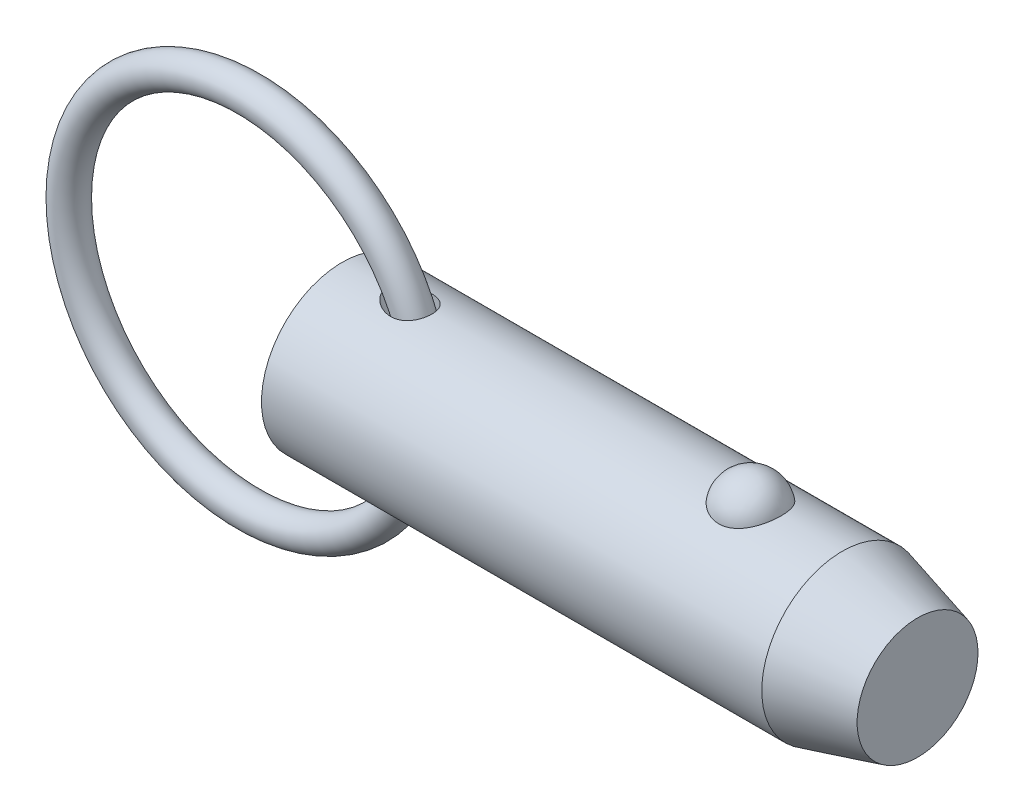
ISO-10303-21;
HEADER;
FILE_DESCRIPTION(('STEP AP214'),'2;1');
FILE_NAME('part.step','',(''),(''),'','','');
FILE_SCHEMA(('AUTOMOTIVE_DESIGN { 1 0 10303 214 1 1 1 1 }'));
ENDSEC;
DATA;
#1=APPLICATION_CONTEXT('core data for automotive mechanical design processes');
#2=APPLICATION_PROTOCOL_DEFINITION('international standard','automotive_design',2000,#1);
#3=PRODUCT_CONTEXT('',#1,'mechanical');
#4=PRODUCT('Part','Part','',(#3));
#5=PRODUCT_RELATED_PRODUCT_CATEGORY('part','',(#4));
#6=PRODUCT_DEFINITION_FORMATION('','',#4);
#7=PRODUCT_DEFINITION_CONTEXT('part definition',#1,'design');
#8=PRODUCT_DEFINITION('design','',#6,#7);
#9=PRODUCT_DEFINITION_SHAPE('','',#8);
#10=(LENGTH_UNIT() NAMED_UNIT(*) SI_UNIT(.MILLI.,.METRE.));
#11=(NAMED_UNIT(*) PLANE_ANGLE_UNIT() SI_UNIT($,.RADIAN.));
#12=(NAMED_UNIT(*) SI_UNIT($,.STERADIAN.) SOLID_ANGLE_UNIT());
#13=UNCERTAINTY_MEASURE_WITH_UNIT(LENGTH_MEASURE(1.E-05),#10,'distance_accuracy_value','');
#14=(GEOMETRIC_REPRESENTATION_CONTEXT(3) GLOBAL_UNCERTAINTY_ASSIGNED_CONTEXT((#13)) GLOBAL_UNIT_ASSIGNED_CONTEXT((#10,
#11,#12)) REPRESENTATION_CONTEXT('',''));
#15=CARTESIAN_POINT('',(0.,0.,0.));
#16=DIRECTION('',(0.,0.,1.));
#17=DIRECTION('',(1.,0.,0.));
#18=AXIS2_PLACEMENT_3D('',#15,#16,#17);
#19=CARTESIAN_POINT('',(-8.23730968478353,0.,0.));
#20=DIRECTION('',(0.,0.,1.));
#21=DIRECTION('',(1.,0.,0.));
#22=AXIS2_PLACEMENT_3D('',#19,#20,#21);
#23=TOROIDAL_SURFACE('',#22,15.875,1.422);
#24=CARTESIAN_POINT('',(9.05969031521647,0.,0.));
#25=VERTEX_POINT('',#24);
#26=VERTEX_LOOP('',#25);
#27=FACE_BOUND('',#26,.T.);
#28=ADVANCED_FACE('P0_F12',(#27),#23,.T.);
#29=CLOSED_SHELL('',(#28));
#30=MANIFOLD_SOLID_BREP('P0_B1',#29);
#31=CARTESIAN_POINT('',(0.,0.,0.));
#32=DIRECTION('',(1.,0.,0.));
#33=DIRECTION('',(0.,0.,-1.));
#34=AXIS2_PLACEMENT_3D('',#31,#32,#33);
#35=CYLINDRICAL_SURFACE('',#34,7.11);
#36=CARTESIAN_POINT('',(3.98467340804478,7.10072679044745,-0.363013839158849));
#37=CARTESIAN_POINT('',(4.00971652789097,7.09600153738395,-0.45539194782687));
#38=CARTESIAN_POINT('',(4.04401947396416,7.08958406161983,-0.545230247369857));
#39=CARTESIAN_POINT('',(4.12810160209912,7.07427055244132,-0.717157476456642));
#40=CARTESIAN_POINT('',(4.17791765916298,7.06536861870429,-0.799227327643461));
#41=CARTESIAN_POINT('',(4.28924471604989,7.04620300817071,-0.953469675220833));
#42=CARTESIAN_POINT('',(4.35063580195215,7.035953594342,-1.02573162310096));
#43=CARTESIAN_POINT('',(4.48282610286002,7.01493313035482,-1.16081412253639));
#44=CARTESIAN_POINT('',(4.55362244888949,7.00416223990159,-1.22363754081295));
#45=CARTESIAN_POINT('',(4.71659336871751,6.98090398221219,-1.35055080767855));
#46=CARTESIAN_POINT('',(4.81029272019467,6.96847103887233,-1.41269256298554));
#47=CARTESIAN_POINT('',(5.0057240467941,6.94515366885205,-1.52319699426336));
#48=CARTESIAN_POINT('',(5.10746392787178,6.93427079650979,-1.57154588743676));
#49=CARTESIAN_POINT('',(5.33503739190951,6.91346066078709,-1.66091325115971));
#50=CARTESIAN_POINT('',(5.46199550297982,6.90402388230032,-1.69921932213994));
#51=CARTESIAN_POINT('',(5.72084799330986,6.89024030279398,-1.75428261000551));
#52=CARTESIAN_POINT('',(5.85274301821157,6.88589416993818,-1.77103699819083));
#53=CARTESIAN_POINT('',(6.11557710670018,6.88337277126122,-1.78081990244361));
#54=CARTESIAN_POINT('',(6.24650031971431,6.88510489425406,-1.77420448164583));
#55=CARTESIAN_POINT('',(6.50446311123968,6.89478744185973,-1.73620392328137));
#56=CARTESIAN_POINT('',(6.6315075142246,6.90272978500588,-1.70485097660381));
#57=CARTESIAN_POINT('',(6.85933269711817,6.92243075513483,-1.62281888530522));
#58=CARTESIAN_POINT('',(6.96133251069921,6.93352131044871,-1.5753580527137));
#59=CARTESIAN_POINT('',(7.15436649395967,6.95824811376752,-1.46226310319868));
#60=CARTESIAN_POINT('',(7.24540699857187,6.97188287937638,-1.3966395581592));
#61=CARTESIAN_POINT('',(7.40446019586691,6.99838217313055,-1.25668991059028));
#62=CARTESIAN_POINT('',(7.473875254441,7.01118308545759,-1.18393777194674));
#63=CARTESIAN_POINT('',(7.59904891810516,7.03582803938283,-1.02736918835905));
#64=CARTESIAN_POINT('',(7.65481029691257,7.04767227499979,-0.943554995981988));
#65=CARTESIAN_POINT('',(7.74982438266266,7.06873077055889,-0.76979592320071));
#66=CARTESIAN_POINT('',(7.7894903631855,7.07800861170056,-0.680084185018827));
#67=CARTESIAN_POINT('',(7.85354088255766,7.09334756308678,-0.495102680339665));
#68=CARTESIAN_POINT('',(7.87792559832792,7.09940871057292,-0.399832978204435));
#69=CARTESIAN_POINT('',(7.9108898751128,7.10766731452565,-0.206294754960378));
#70=CARTESIAN_POINT('',(7.91944662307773,7.10985919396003,-0.108022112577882));
#71=CARTESIAN_POINT('',(7.920501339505,7.11012756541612,0.0886168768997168));
#72=CARTESIAN_POINT('',(7.91299895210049,7.10820396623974,0.186983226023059));
#73=CARTESIAN_POINT('',(7.88205794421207,7.10043733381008,0.381270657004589));
#74=CARTESIAN_POINT('',(7.85857985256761,7.09458459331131,0.477185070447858));
#75=CARTESIAN_POINT('',(7.79617406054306,7.07958431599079,0.663575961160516));
#76=CARTESIAN_POINT('',(7.75724672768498,7.07043685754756,0.754052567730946));
#77=CARTESIAN_POINT('',(7.66496731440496,7.04987259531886,0.926798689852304));
#78=CARTESIAN_POINT('',(7.61164530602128,7.0384605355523,1.00908483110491));
#79=CARTESIAN_POINT('',(7.49191707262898,7.01461776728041,1.16333092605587));
#80=CARTESIAN_POINT('',(7.42551210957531,7.00218715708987,1.235291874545));
#81=CARTESIAN_POINT('',(7.28164031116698,6.97770944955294,1.36680167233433));
#82=CARTESIAN_POINT('',(7.20420170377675,6.96566146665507,1.42638126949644));
#83=CARTESIAN_POINT('',(7.0403906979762,6.94319963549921,1.53199377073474));
#84=CARTESIAN_POINT('',(6.95401827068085,6.93278579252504,1.57802663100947));
#85=CARTESIAN_POINT('',(6.7731858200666,6.91444459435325,1.65656940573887));
#86=CARTESIAN_POINT('',(6.67860569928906,6.90656682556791,1.68881327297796));
#87=CARTESIAN_POINT('',(6.48544119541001,6.89422806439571,1.73849768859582));
#88=CARTESIAN_POINT('',(6.38685561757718,6.88976809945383,1.755933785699));
#89=CARTESIAN_POINT('',(6.18089829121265,6.88429907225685,1.77726234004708));
#90=CARTESIAN_POINT('',(6.07340937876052,6.88356485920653,1.78007646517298));
#91=CARTESIAN_POINT('',(5.85921220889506,6.886086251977,1.77029087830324));
#92=CARTESIAN_POINT('',(5.75250426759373,6.88934339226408,1.75768523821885));
#93=CARTESIAN_POINT('',(5.52848027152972,6.89994454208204,1.71563399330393));
#94=CARTESIAN_POINT('',(5.41155168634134,6.90775772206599,1.68424184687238));
#95=CARTESIAN_POINT('',(5.18376466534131,6.92670168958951,1.60454711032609));
#96=CARTESIAN_POINT('',(5.07291446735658,6.9378368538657,1.5562221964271));
#97=CARTESIAN_POINT('',(4.84835244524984,6.96347168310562,1.43744827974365));
#98=CARTESIAN_POINT('',(4.73562531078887,6.97820486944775,1.36517310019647));
#99=CARTESIAN_POINT('',(4.52504912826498,7.00822340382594,1.20158053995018));
#100=CARTESIAN_POINT('',(4.42717478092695,7.02350775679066,1.11029618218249));
#101=CARTESIAN_POINT('',(4.27935716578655,7.04784659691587,0.940654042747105));
#102=CARTESIAN_POINT('',(4.2239722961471,7.05736064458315,0.867099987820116));
#103=CARTESIAN_POINT('',(4.12558347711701,7.07469854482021,0.711919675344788));
#104=CARTESIAN_POINT('',(4.08256922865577,7.0825238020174,0.630300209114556));
#105=CARTESIAN_POINT('',(4.01142860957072,7.09565978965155,0.459428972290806));
#106=CARTESIAN_POINT('',(3.98346043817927,7.10094374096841,0.370107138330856));
#107=CARTESIAN_POINT('',(3.95517285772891,7.1063173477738,0.233358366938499));
#108=CARTESIAN_POINT('',(3.94802115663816,7.1076831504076,0.187321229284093));
#109=CARTESIAN_POINT('',(3.93842121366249,7.10951900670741,0.0947476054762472));
#110=CARTESIAN_POINT('',(3.93597129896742,7.10998937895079,0.0482113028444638));
#111=CARTESIAN_POINT('',(3.93584361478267,7.11001358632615,-0.0598597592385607));
#112=CARTESIAN_POINT('',(3.9399538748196,7.10922402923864,-0.121405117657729));
#113=CARTESIAN_POINT('',(3.95632793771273,7.10609781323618,-0.243320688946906));
#114=CARTESIAN_POINT('',(3.96859135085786,7.10376122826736,-0.303690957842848));
#115=CARTESIAN_POINT('',(3.98467340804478,7.10072679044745,-0.363013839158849));
#116=B_SPLINE_CURVE_WITH_KNOTS('',3,(#36,#37,#38,#39,#40,#41,#42,#43,#44,#45,#46,#47,#48,#49,
#50,#51,#52,#53,#54,#55,#56,#57,#58,#59,#60,#61,#62,#63,#64,#65,#66,#67,#68,#69,#70,#71,#72,#73,
#74,#75,#76,#77,#78,#79,#80,#81,#82,#83,#84,#85,#86,#87,#88,#89,#90,#91,#92,#93,#94,#95,#96,#97,
#98,#99,#100,#101,#102,#103,#104,#105,#106,#107,#108,#109,#110,#111,#112,#113,#114,#115),
.UNSPECIFIED.,.T.,.F.,(4,2,2,2,2,2,2,2,2,2,2,2,2,2,2,2,2,2,2,2,2,2,2,2,2,2,2,2,2,2,2,2,2,2,2,2,
2,2,2,4),(0.,0.287206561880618,0.575101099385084,0.860162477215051,1.14513709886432,
1.48324846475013,1.82169652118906,2.21865672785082,2.6156690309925,3.00665870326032,
3.39714041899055,3.73437585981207,4.07141541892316,4.37402271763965,4.67656849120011,
4.97076150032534,5.26495110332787,5.55956439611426,5.85418421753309,6.14953461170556,
6.44487798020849,6.73960905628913,7.03431171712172,7.32827352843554,7.6222362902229,
7.9216396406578,8.22113296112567,8.54242840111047,8.86384740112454,9.22635035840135,
9.58933304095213,9.99153142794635,10.3930368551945,10.6697219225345,10.9461759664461,
11.2254825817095,11.3650959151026,11.5046595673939,11.6891051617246,11.8735419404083),.UNSPECIFIED.);
#117=CARTESIAN_POINT('',(3.98467340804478,7.10072679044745,-0.363013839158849));
#118=VERTEX_POINT('',#117);
#119=EDGE_CURVE('P1_E40',#118,#118,#116,.T.);
#120=ORIENTED_EDGE('',*,*,#119,.T.);
#121=EDGE_LOOP('',(#120));
#122=FACE_BOUND('',#121,.T.);
#123=CARTESIAN_POINT('',(44.1362796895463,0.,0.));
#124=DIRECTION('',(1.,0.,0.));
#125=DIRECTION('',(0.,0.,-1.));
#126=AXIS2_PLACEMENT_3D('',#123,#124,#125);
#127=CIRCLE('',#126,7.11);
#128=CARTESIAN_POINT('',(44.1362796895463,0.,-7.11));
#129=VERTEX_POINT('',#128);
#130=EDGE_CURVE('P1_E25',#129,#129,#127,.T.);
#131=ORIENTED_EDGE('',*,*,#130,.F.);
#132=EDGE_LOOP('',(#131));
#133=FACE_BOUND('',#132,.T.);
#134=CARTESIAN_POINT('',(0.,0.,0.));
#135=DIRECTION('',(1.,0.,0.));
#136=DIRECTION('',(0.,0.,-1.));
#137=AXIS2_PLACEMENT_3D('',#134,#135,#136);
#138=CIRCLE('',#137,7.11);
#139=CARTESIAN_POINT('',(0.,0.,-7.11));
#140=VERTEX_POINT('',#139);
#141=EDGE_CURVE('P1_E9',#140,#140,#138,.T.);
#142=ORIENTED_EDGE('',*,*,#141,.T.);
#143=EDGE_LOOP('',(#142));
#144=FACE_BOUND('',#143,.T.);
#145=CARTESIAN_POINT('',(36.029258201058,6.5364666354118,2.79762469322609));
#146=CARTESIAN_POINT('',(35.8844296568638,6.53647876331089,2.79761243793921));
#147=CARTESIAN_POINT('',(35.739368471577,6.54144531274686,2.78608115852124));
#148=CARTESIAN_POINT('',(35.4532920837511,6.56077791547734,2.7402328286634));
#149=CARTESIAN_POINT('',(35.3122884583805,6.5751685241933,2.7058562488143));
#150=CARTESIAN_POINT('',(35.0388833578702,6.61165072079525,2.61544042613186));
#151=CARTESIAN_POINT('',(34.9064602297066,6.63372195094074,2.55945840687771));
#152=CARTESIAN_POINT('',(34.6532337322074,6.68316012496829,2.42742958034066));
#153=CARTESIAN_POINT('',(34.5324254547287,6.71052481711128,2.35139129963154));
#154=CARTESIAN_POINT('',(34.3016372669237,6.76860821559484,2.17866150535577));
#155=CARTESIAN_POINT('',(34.1920857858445,6.79940242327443,2.08142342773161));
#156=CARTESIAN_POINT('',(33.9903340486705,6.86050242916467,1.87020907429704));
#157=CARTESIAN_POINT('',(33.8981390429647,6.89080807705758,1.75622775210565));
#158=CARTESIAN_POINT('',(33.7292547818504,6.94923069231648,1.50900646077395));
#159=CARTESIAN_POINT('',(33.6534289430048,6.97719213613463,1.37513873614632));
#160=CARTESIAN_POINT('',(33.5242063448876,7.02647251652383,1.09584817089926));
#161=CARTESIAN_POINT('',(33.4708109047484,7.04779106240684,0.950424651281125));
#162=CARTESIAN_POINT('',(33.3871019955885,7.08180248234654,0.650508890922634));
#163=CARTESIAN_POINT('',(33.3570253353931,7.09440672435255,0.495940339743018));
#164=CARTESIAN_POINT('',(33.3214735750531,7.10935121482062,0.183515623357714));
#165=CARTESIAN_POINT('',(33.3159974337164,7.11169189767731,0.0256595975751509));
#166=CARTESIAN_POINT('',(33.329700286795,7.10589702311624,-0.287512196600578));
#167=CARTESIAN_POINT('',(33.3486823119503,7.0978451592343,-0.442838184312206));
#168=CARTESIAN_POINT('',(33.4105745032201,7.07221860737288,-0.747830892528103));
#169=CARTESIAN_POINT('',(33.4534850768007,7.05464375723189,-0.897497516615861));
#170=CARTESIAN_POINT('',(33.5624527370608,7.01171031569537,-1.18722864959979));
#171=CARTESIAN_POINT('',(33.6285458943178,6.98633960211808,-1.32727778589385));
#172=CARTESIAN_POINT('',(33.7825362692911,6.93042258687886,-1.59370324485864));
#173=CARTESIAN_POINT('',(33.8704355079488,6.89987580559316,-1.7200782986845));
#174=CARTESIAN_POINT('',(34.0669269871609,6.83659510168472,-1.95657345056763));
#175=CARTESIAN_POINT('',(34.1756640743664,6.80384697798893,-2.06656957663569));
#176=CARTESIAN_POINT('',(34.4109686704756,6.7400183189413,-2.26611005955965));
#177=CARTESIAN_POINT('',(34.5375350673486,6.70893767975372,-2.35565569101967));
#178=CARTESIAN_POINT('',(34.8028454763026,6.65264442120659,-2.51019726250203));
#179=CARTESIAN_POINT('',(34.9413230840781,6.62733449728,-2.57561395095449));
#180=CARTESIAN_POINT('',(35.2285194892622,6.58495995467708,-2.68211134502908));
#181=CARTESIAN_POINT('',(35.3772343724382,6.56789220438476,-2.7232012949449));
#182=CARTESIAN_POINT('',(35.6726268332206,6.54478663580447,-2.77825810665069));
#183=CARTESIAN_POINT('',(35.8190295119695,6.53823639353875,-2.79348727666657));
#184=CARTESIAN_POINT('',(36.1124700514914,6.53532718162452,-2.80028921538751));
#185=CARTESIAN_POINT('',(36.2595077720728,6.53896606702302,-2.79186696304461));
#186=CARTESIAN_POINT('',(36.5449210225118,6.55570357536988,-2.75232178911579));
#187=CARTESIAN_POINT('',(36.6834221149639,6.56848455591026,-2.72196077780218));
#188=CARTESIAN_POINT('',(36.9531142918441,6.60173528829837,-2.64028774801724));
#189=CARTESIAN_POINT('',(37.084304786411,6.62220565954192,-2.58897404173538));
#190=CARTESIAN_POINT('',(37.3388462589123,6.66917927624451,-2.4654782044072));
#191=CARTESIAN_POINT('',(37.4619691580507,6.69580233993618,-2.39287266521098));
#192=CARTESIAN_POINT('',(37.6944418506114,6.75207041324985,-2.22915269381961));
#193=CARTESIAN_POINT('',(37.8037884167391,6.78171612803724,-2.13803393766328));
#194=CARTESIAN_POINT('',(38.011642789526,6.84264629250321,-1.93445592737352));
#195=CARTESIAN_POINT('',(38.1093178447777,6.87393748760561,-1.82114774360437));
#196=CARTESIAN_POINT('',(38.2850112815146,6.93345710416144,-1.57947787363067));
#197=CARTESIAN_POINT('',(38.3630261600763,6.96168497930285,-1.4511135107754));
#198=CARTESIAN_POINT('',(38.4999857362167,7.01307558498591,-1.17842708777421));
#199=CARTESIAN_POINT('',(38.5582588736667,7.03605262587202,-1.03373189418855));
#200=CARTESIAN_POINT('',(38.6510815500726,7.07340932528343,-0.735867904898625));
#201=CARTESIAN_POINT('',(38.6856311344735,7.08778900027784,-0.582699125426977));
#202=CARTESIAN_POINT('',(38.7302742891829,7.10647639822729,-0.272420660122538));
#203=CARTESIAN_POINT('',(38.74039710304,7.11079616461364,-0.115315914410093));
#204=CARTESIAN_POINT('',(38.736061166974,7.10896059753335,0.198488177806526));
#205=CARTESIAN_POINT('',(38.7216031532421,7.10280557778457,0.355187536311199));
#206=CARTESIAN_POINT('',(38.6685727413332,7.08071500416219,0.662724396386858));
#207=CARTESIAN_POINT('',(38.6301505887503,7.06484039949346,0.813592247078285));
#208=CARTESIAN_POINT('',(38.530101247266,7.0249589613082,1.10629159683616));
#209=CARTESIAN_POINT('',(38.4684724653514,7.00095156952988,1.24812247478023));
#210=CARTESIAN_POINT('',(38.3227668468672,6.94706632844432,1.51976439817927));
#211=CARTESIAN_POINT('',(38.2385448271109,6.91715085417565,1.64949012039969));
#212=CARTESIAN_POINT('',(38.0495861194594,6.8547056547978,1.89231285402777));
#213=CARTESIAN_POINT('',(37.9448501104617,6.82217601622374,2.00541041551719));
#214=CARTESIAN_POINT('',(37.7171030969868,6.75805358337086,2.21190674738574));
#215=CARTESIAN_POINT('',(37.594082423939,6.72646129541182,2.30529503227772));
#216=CARTESIAN_POINT('',(37.3327347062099,6.66789520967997,2.46959908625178));
#217=CARTESIAN_POINT('',(37.1944019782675,6.64092313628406,2.54050647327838));
#218=CARTESIAN_POINT('',(36.9111828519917,6.5957258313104,2.65560045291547));
#219=CARTESIAN_POINT('',(36.7666660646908,6.57724013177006,2.70059539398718));
#220=CARTESIAN_POINT('',(36.4715469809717,6.55006426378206,2.76587321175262));
#221=CARTESIAN_POINT('',(36.3209640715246,6.54134511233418,2.78622922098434));
#222=CARTESIAN_POINT('',(36.1230463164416,6.53697847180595,2.79642434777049));
#223=CARTESIAN_POINT('',(36.0761644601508,6.53646270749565,2.79762866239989));
#224=CARTESIAN_POINT('',(36.029258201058,6.5364666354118,2.79762469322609));
#225=B_SPLINE_CURVE_WITH_KNOTS('',3,(#145,#146,#147,#148,#149,#150,#151,#152,#153,#154,#155,
#156,#157,#158,#159,#160,#161,#162,#163,#164,#165,#166,#167,#168,#169,#170,#171,#172,#173,#174,
#175,#176,#177,#178,#179,#180,#181,#182,#183,#184,#185,#186,#187,#188,#189,#190,#191,#192,#193,
#194,#195,#196,#197,#198,#199,#200,#201,#202,#203,#204,#205,#206,#207,#208,#209,#210,#211,#212,
#213,#214,#215,#216,#217,#218,#219,#220,#221,#222,#223,#224),.UNSPECIFIED.,.T.,.F.,(4,2,2,2,2,2,
2,2,2,2,2,2,2,2,2,2,2,2,2,2,2,2,2,2,2,2,2,2,2,2,2,2,2,2,2,2,2,2,2,4),(0.,0.434355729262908,
0.869847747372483,1.30419416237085,1.73835621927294,2.18541922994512,2.63261726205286,
3.09954261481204,3.56649542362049,4.03813031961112,4.50974525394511,4.97758575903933,
5.44543423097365,5.91401389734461,6.38263700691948,6.85464418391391,7.32662193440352,
7.78992971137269,8.25306131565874,8.69285754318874,9.13256119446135,9.5576862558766,
9.98284556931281,10.4171106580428,10.8514772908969,11.3079089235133,11.7644218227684,
12.2351898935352,12.7059570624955,13.1761603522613,13.6463495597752,14.1136200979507,
14.580922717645,15.0513032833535,15.5216682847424,15.9922828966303,16.4630727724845,
16.9182457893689,17.3720644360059,17.5127411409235),.UNSPECIFIED.);
#226=CARTESIAN_POINT('',(36.029258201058,6.5364666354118,2.79762469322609));
#227=VERTEX_POINT('',#226);
#228=EDGE_CURVE('P1_E34',#227,#227,#225,.T.);
#229=ORIENTED_EDGE('',*,*,#228,.T.);
#230=EDGE_LOOP('',(#229));
#231=FACE_BOUND('',#230,.T.);
#232=CARTESIAN_POINT('',(3.98467340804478,-7.10072679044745,-0.363013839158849));
#233=CARTESIAN_POINT('',(3.96426456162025,-7.10457733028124,-0.287714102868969));
#234=CARTESIAN_POINT('',(3.95000501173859,-7.10730349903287,-0.210695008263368));
#235=CARTESIAN_POINT('',(3.93481801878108,-7.11020840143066,-0.0553038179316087));
#236=CARTESIAN_POINT('',(3.93388435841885,-7.11038832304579,0.0230676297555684));
#237=CARTESIAN_POINT('',(3.94541910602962,-7.10817995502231,0.178714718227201));
#238=CARTESIAN_POINT('',(3.95787987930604,-7.10579312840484,0.25599095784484));
#239=CARTESIAN_POINT('',(3.99523775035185,-7.09872642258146,0.407352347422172));
#240=CARTESIAN_POINT('',(4.02014065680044,-7.09404547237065,0.481435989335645));
#241=CARTESIAN_POINT('',(4.08119600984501,-7.08278363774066,0.625775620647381));
#242=CARTESIAN_POINT('',(4.11749458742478,-7.07617815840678,0.695967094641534));
#243=CARTESIAN_POINT('',(4.19940836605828,-7.06165305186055,0.830508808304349));
#244=CARTESIAN_POINT('',(4.24502952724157,-7.0537325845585,0.894855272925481));
#245=CARTESIAN_POINT('',(4.36790232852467,-7.03310314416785,1.04688574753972));
#246=CARTESIAN_POINT('',(4.44977459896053,-7.01993229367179,1.13078695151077));
#247=CARTESIAN_POINT('',(4.62610796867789,-6.99351259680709,1.28411726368));
#248=CARTESIAN_POINT('',(4.7205898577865,-6.98026365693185,1.35352197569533));
#249=CARTESIAN_POINT('',(4.92036507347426,-6.9549104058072,1.47831921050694));
#250=CARTESIAN_POINT('',(5.02579054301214,-6.94282458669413,1.53350332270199));
#251=CARTESIAN_POINT('',(5.24378330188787,-6.92129098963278,1.62793610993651));
#252=CARTESIAN_POINT('',(5.35635066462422,-6.91184323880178,1.66718462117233));
#253=CARTESIAN_POINT('',(5.60134354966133,-6.89573491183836,1.73269893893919));
#254=CARTESIAN_POINT('',(5.73444697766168,-6.8895970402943,1.75661057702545));
#255=CARTESIAN_POINT('',(6.00300738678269,-6.88344616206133,1.78057487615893));
#256=CARTESIAN_POINT('',(6.13846360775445,-6.88343121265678,1.78063510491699));
#257=CARTESIAN_POINT('',(6.39660470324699,-6.88981379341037,1.75576480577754));
#258=CARTESIAN_POINT('',(6.51947843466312,-6.89572457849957,1.73273121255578));
#259=CARTESIAN_POINT('',(6.75813770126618,-6.91274434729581,1.66352936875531));
#260=CARTESIAN_POINT('',(6.87393155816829,-6.92384709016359,1.61738888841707));
#261=CARTESIAN_POINT('',(7.07801861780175,-6.94787316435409,1.51052664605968));
#262=CARTESIAN_POINT('',(7.16789841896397,-6.96033024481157,1.45271574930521));
#263=CARTESIAN_POINT('',(7.33546773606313,-6.98638661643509,1.32171912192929));
#264=CARTESIAN_POINT('',(7.41316182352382,-6.99998547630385,1.24853918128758));
#265=CARTESIAN_POINT('',(7.54861420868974,-7.02559503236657,1.09486170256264));
#266=CARTESIAN_POINT('',(7.60741145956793,-7.03764930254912,1.01528346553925));
#267=CARTESIAN_POINT('',(7.71070740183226,-7.0598657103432,0.847099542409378));
#268=CARTESIAN_POINT('',(7.75520788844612,-7.0700280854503,0.758494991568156));
#269=CARTESIAN_POINT('',(7.82836147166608,-7.08722075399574,0.575936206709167));
#270=CARTESIAN_POINT('',(7.85719783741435,-7.09428707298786,0.482058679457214));
#271=CARTESIAN_POINT('',(7.89918378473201,-7.10470260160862,0.29065874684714));
#272=CARTESIAN_POINT('',(7.91233308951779,-7.10805174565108,0.193136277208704));
#273=CARTESIAN_POINT('',(7.92267451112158,-7.11067890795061,-0.00313968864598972));
#274=CARTESIAN_POINT('',(7.91981203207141,-7.10994299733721,-0.10189624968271));
#275=CARTESIAN_POINT('',(7.89806489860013,-7.10444651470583,-0.297516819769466));
#276=CARTESIAN_POINT('',(7.87918005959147,-7.09968589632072,-0.394380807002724));
#277=CARTESIAN_POINT('',(7.82577988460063,-7.0866471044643,-0.58355375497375));
#278=CARTESIAN_POINT('',(7.79124976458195,-7.07836560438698,-0.675858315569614));
#279=CARTESIAN_POINT('',(7.70736343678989,-7.05919003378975,-0.853167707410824));
#280=CARTESIAN_POINT('',(7.65800801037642,-7.04829610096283,-0.938172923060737));
#281=CARTESIAN_POINT('',(7.54590141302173,-7.02513961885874,-1.09819812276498));
#282=CARTESIAN_POINT('',(7.48319521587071,-7.01288172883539,-1.17325029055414));
#283=CARTESIAN_POINT('',(7.34599775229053,-6.98832192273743,-1.31164333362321));
#284=CARTESIAN_POINT('',(7.27150757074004,-6.97602001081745,-1.37498528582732));
#285=CARTESIAN_POINT('',(7.11277776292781,-6.95268608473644,-1.48849974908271));
#286=CARTESIAN_POINT('',(7.02852525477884,-6.94165578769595,-1.53865456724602));
#287=CARTESIAN_POINT('',(6.85282430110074,-6.92200320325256,-1.62478650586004));
#288=CARTESIAN_POINT('',(6.76137511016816,-6.91338116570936,-1.66076215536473));
#289=CARTESIAN_POINT('',(6.57061179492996,-6.89906044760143,-1.71930563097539));
#290=CARTESIAN_POINT('',(6.47113516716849,-6.89347290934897,-1.74136795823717));
#291=CARTESIAN_POINT('',(6.26989833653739,-6.88605020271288,-1.7704895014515));
#292=CARTESIAN_POINT('',(6.16813737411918,-6.88421630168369,-1.77754365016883));
#293=CARTESIAN_POINT('',(5.95492537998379,-6.88424071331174,-1.77745174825));
#294=CARTESIAN_POINT('',(5.8434768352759,-6.88646827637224,-1.76888555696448));
#295=CARTESIAN_POINT('',(5.62307560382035,-6.89483827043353,-1.73596677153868));
#296=CARTESIAN_POINT('',(5.51412477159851,-6.90098351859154,-1.71160281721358));
#297=CARTESIAN_POINT('',(5.28644478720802,-6.91743803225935,-1.64393691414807));
#298=CARTESIAN_POINT('',(5.16837217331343,-6.92819628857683,-1.59852806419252));
#299=CARTESIAN_POINT('',(4.94091825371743,-6.95234836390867,-1.4899796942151));
#300=CARTESIAN_POINT('',(4.83153887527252,-6.96574276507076,-1.42683625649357));
#301=CARTESIAN_POINT('',(4.63576710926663,-6.99209234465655,-1.29112257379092));
#302=CARTESIAN_POINT('',(4.54816728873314,-7.00494184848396,-1.22027748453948));
#303=CARTESIAN_POINT('',(4.38554897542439,-7.03019055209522,-1.0652111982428));
#304=CARTESIAN_POINT('',(4.31052141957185,-7.04259007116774,-0.980999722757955));
#305=CARTESIAN_POINT('',(4.18551811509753,-7.0640229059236,-0.811206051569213));
#306=CARTESIAN_POINT('',(4.13358417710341,-7.07328321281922,-0.727107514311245));
#307=CARTESIAN_POINT('',(4.04607461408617,-7.0891994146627,-0.550580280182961));
#308=CARTESIAN_POINT('',(4.01046401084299,-7.09586087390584,-0.458169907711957));
#309=CARTESIAN_POINT('',(3.98467340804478,-7.10072679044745,-0.363013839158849));
#310=B_SPLINE_CURVE_WITH_KNOTS('',3,(#232,#233,#234,#235,#236,#237,#238,#239,#240,#241,#242,
#243,#244,#245,#246,#247,#248,#249,#250,#251,#252,#253,#254,#255,#256,#257,#258,#259,#260,#261,
#262,#263,#264,#265,#266,#267,#268,#269,#270,#271,#272,#273,#274,#275,#276,#277,#278,#279,#280,
#281,#282,#283,#284,#285,#286,#287,#288,#289,#290,#291,#292,#293,#294,#295,#296,#297,#298,#299,
#300,#301,#302,#303,#304,#305,#306,#307,#308,#309),.UNSPECIFIED.,.T.,.F.,(4,2,2,2,2,2,2,2,2,2,2,
2,2,2,2,2,2,2,2,2,2,2,2,2,2,2,2,2,2,2,2,2,2,2,2,2,2,2,4),(0.,0.23402065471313,0.467932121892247,
0.701710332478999,0.935597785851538,1.17261620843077,1.40978663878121,1.76177576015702,
2.11435255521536,2.47183528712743,2.8293216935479,3.23332937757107,3.63720887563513,
4.01042610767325,4.38319587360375,4.70425151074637,5.02518641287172,5.32277979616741,
5.62033579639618,5.91433101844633,6.2083314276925,6.50333490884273,6.79834178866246,
7.09362801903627,7.38889868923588,7.6831900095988,7.9774542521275,8.27211131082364,
8.56679892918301,8.8716552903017,9.17661456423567,9.51069129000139,9.84500851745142,
10.2243046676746,10.6036846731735,10.9425776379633,11.2812252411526,11.5775945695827,
11.8733258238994),.UNSPECIFIED.);
#311=CARTESIAN_POINT('',(3.98467340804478,-7.10072679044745,-0.363013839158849));
#312=VERTEX_POINT('',#311);
#313=EDGE_CURVE('P1_E17',#312,#312,#310,.T.);
#314=ORIENTED_EDGE('',*,*,#313,.T.);
#315=EDGE_LOOP('',(#314));
#316=FACE_BOUND('',#315,.T.);
#317=ADVANCED_FACE('P1_F13',(#122,#133,#144,#231,#316),#35,.T.);
#318=CARTESIAN_POINT('',(0.,0.,0.));
#319=DIRECTION('',(-1.,0.,0.));
#320=DIRECTION('',(0.,0.,1.));
#321=AXIS2_PLACEMENT_3D('',#318,#319,#320);
#322=PLANE('',#321);
#323=ORIENTED_EDGE('',*,*,#141,.F.);
#324=EDGE_LOOP('',(#323));
#325=FACE_BOUND('',#324,.T.);
#326=ADVANCED_FACE('P1_F15',(#325),#322,.T.);
#327=CARTESIAN_POINT('',(50.77,0.,0.));
#328=DIRECTION('',(-1.,0.,0.));
#329=DIRECTION('',(0.,0.,1.));
#330=AXIS2_PLACEMENT_3D('',#327,#328,#329);
#331=CONICAL_SURFACE('',#330,5.33250000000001,0.26179938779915);
#332=ORIENTED_EDGE('',*,*,#130,.T.);
#333=EDGE_LOOP('',(#332));
#334=FACE_BOUND('',#333,.T.);
#335=CARTESIAN_POINT('',(50.77,0.,0.));
#336=DIRECTION('',(1.,0.,0.));
#337=DIRECTION('',(0.,0.,-1.));
#338=AXIS2_PLACEMENT_3D('',#335,#336,#337);
#339=CIRCLE('',#338,5.33250000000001);
#340=CARTESIAN_POINT('',(50.77,0.,-5.33250000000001));
#341=VERTEX_POINT('',#340);
#342=EDGE_CURVE('P1_E30',#341,#341,#339,.T.);
#343=ORIENTED_EDGE('',*,*,#342,.F.);
#344=EDGE_LOOP('',(#343));
#345=FACE_BOUND('',#344,.T.);
#346=ADVANCED_FACE('P1_F55',(#334,#345),#331,.T.);
#347=CARTESIAN_POINT('',(50.77,5.33250000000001,0.));
#348=DIRECTION('',(1.,0.,0.));
#349=DIRECTION('',(0.,0.,-1.));
#350=AXIS2_PLACEMENT_3D('',#347,#348,#349);
#351=PLANE('',#350);
#352=ORIENTED_EDGE('',*,*,#342,.T.);
#353=EDGE_LOOP('',(#352));
#354=FACE_BOUND('',#353,.T.);
#355=ADVANCED_FACE('P1_F51',(#354),#351,.T.);
#356=CARTESIAN_POINT('',(36.029258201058,6.399,0.));
#357=DIRECTION('',(-1.,0.,0.));
#358=DIRECTION('',(0.,-1.,0.));
#359=AXIS2_PLACEMENT_3D('',#356,#357,#358);
#360=SPHERICAL_SURFACE('',#359,2.80099999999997);
#361=ORIENTED_EDGE('',*,*,#228,.F.);
#362=EDGE_LOOP('',(#361));
#363=FACE_BOUND('',#362,.T.);
#364=ADVANCED_FACE('P1_F46',(#363),#360,.T.);
#365=CARTESIAN_POINT('',(-8.23730968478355,0.,0.));
#366=DIRECTION('',(0.,0.,1.));
#367=DIRECTION('',(1.,0.,0.));
#368=AXIS2_PLACEMENT_3D('',#365,#366,#367);
#369=TOROIDAL_SURFACE('',#368,15.875,1.7775);
#370=ORIENTED_EDGE('',*,*,#313,.F.);
#371=EDGE_LOOP('',(#370));
#372=FACE_BOUND('',#371,.T.);
#373=ORIENTED_EDGE('',*,*,#119,.F.);
#374=EDGE_LOOP('',(#373));
#375=FACE_BOUND('',#374,.T.);
#376=ADVANCED_FACE('P1_F50',(#372,#375),#369,.F.);
#377=CLOSED_SHELL('',(#317,#326,#346,#355,#364,#376));
#378=MANIFOLD_SOLID_BREP('P1_B1',#377);
#379=ADVANCED_BREP_SHAPE_REPRESENTATION('',(#18,#30,#378),#14);
#380=SHAPE_DEFINITION_REPRESENTATION(#9,#379);
ENDSEC;
END-ISO-10303-21;
